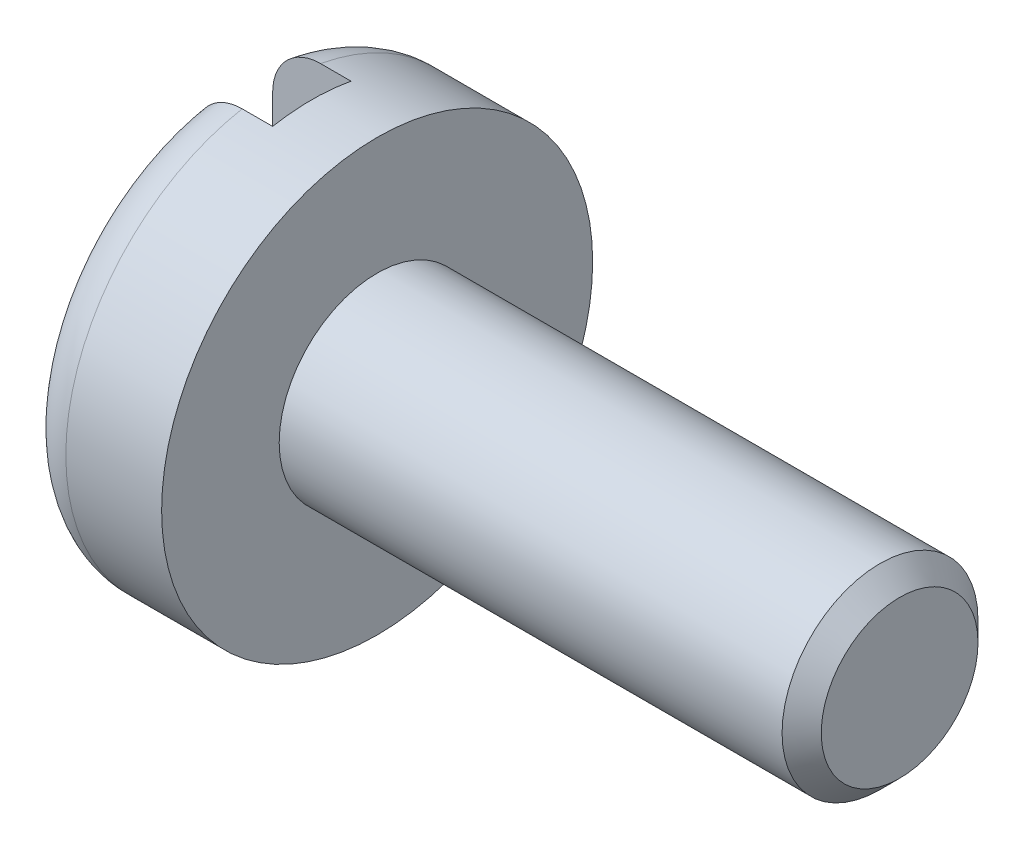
ISO-10303-21;
HEADER;
FILE_DESCRIPTION(('STEP AP214'),'2;1');
FILE_NAME('part.step','',(''),(''),'','','');
FILE_SCHEMA(('AUTOMOTIVE_DESIGN { 1 0 10303 214 1 1 1 1 }'));
ENDSEC;
DATA;
#1=APPLICATION_CONTEXT('core data for automotive mechanical design processes');
#2=APPLICATION_PROTOCOL_DEFINITION('international standard','automotive_design',2000,#1);
#3=PRODUCT_CONTEXT('',#1,'mechanical');
#4=PRODUCT('Part','Part','',(#3));
#5=PRODUCT_RELATED_PRODUCT_CATEGORY('part','',(#4));
#6=PRODUCT_DEFINITION_FORMATION('','',#4);
#7=PRODUCT_DEFINITION_CONTEXT('part definition',#1,'design');
#8=PRODUCT_DEFINITION('design','',#6,#7);
#9=PRODUCT_DEFINITION_SHAPE('','',#8);
#10=(LENGTH_UNIT() NAMED_UNIT(*) SI_UNIT(.MILLI.,.METRE.));
#11=(NAMED_UNIT(*) PLANE_ANGLE_UNIT() SI_UNIT($,.RADIAN.));
#12=(NAMED_UNIT(*) SI_UNIT($,.STERADIAN.) SOLID_ANGLE_UNIT());
#13=UNCERTAINTY_MEASURE_WITH_UNIT(LENGTH_MEASURE(1.E-05),#10,'distance_accuracy_value','');
#14=(GEOMETRIC_REPRESENTATION_CONTEXT(3) GLOBAL_UNCERTAINTY_ASSIGNED_CONTEXT((#13)) GLOBAL_UNIT_ASSIGNED_CONTEXT((#10,
#11,#12)) REPRESENTATION_CONTEXT('',''));
#15=CARTESIAN_POINT('',(0.,0.,0.));
#16=DIRECTION('',(0.,0.,1.));
#17=DIRECTION('',(1.,0.,0.));
#18=AXIS2_PLACEMENT_3D('',#15,#16,#17);
#19=CARTESIAN_POINT('',(-2.19999999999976,0.,-2.56666666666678));
#20=DIRECTION('',(-1.,0.,0.));
#21=DIRECTION('',(0.,0.,1.));
#22=AXIS2_PLACEMENT_3D('',#19,#20,#21);
#23=PLANE('',#22);
#24=DIRECTION('',(0.,1.,0.));
#25=VECTOR('',#24,1.);
#26=CARTESIAN_POINT('',(-2.2000000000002,-3.3,0.599999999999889));
#27=LINE('',#26,#25);
#28=CARTESIAN_POINT('',(-2.2000000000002,-2.49555159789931,0.599999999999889));
#29=VERTEX_POINT('',#28);
#30=CARTESIAN_POINT('',(-2.2000000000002,2.49555159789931,0.599999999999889));
#31=VERTEX_POINT('',#30);
#32=EDGE_CURVE('E514',#29,#31,#27,.T.);
#33=ORIENTED_EDGE('',*,*,#32,.F.);
#34=CARTESIAN_POINT('',(-2.19999999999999,0.,-1.11022302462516E-13));
#35=DIRECTION('',(1.,0.,0.));
#36=DIRECTION('',(0.,0.,-1.));
#37=AXIS2_PLACEMENT_3D('',#34,#35,#36);
#38=CIRCLE('',#37,2.56666666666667);
#39=EDGE_CURVE('E474',#31,#29,#38,.T.);
#40=ORIENTED_EDGE('',*,*,#39,.F.);
#41=EDGE_LOOP('',(#33,#40));
#42=FACE_BOUND('',#41,.T.);
#43=ADVANCED_FACE('F350',(#42),#23,.T.);
#44=CARTESIAN_POINT('',(-1.46666666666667,0.,0.));
#45=DIRECTION('',(1.,0.,0.));
#46=DIRECTION('',(0.,0.,-1.));
#47=AXIS2_PLACEMENT_3D('',#44,#45,#46);
#48=TOROIDAL_SURFACE('',#47,2.56666666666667,0.733333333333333);
#49=ORIENTED_EDGE('',*,*,#39,.T.);
#50=CARTESIAN_POINT('',(-1.85686594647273,-3.1305927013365,0.600000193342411));
#51=CARTESIAN_POINT('',(-1.82259115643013,-3.15252226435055,0.600000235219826));
#52=CARTESIAN_POINT('',(-1.78645539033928,-3.17159394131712,0.600000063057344));
#53=CARTESIAN_POINT('',(-1.71146977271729,-3.20342381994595,0.599999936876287));
#54=CARTESIAN_POINT('',(-1.67261710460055,-3.21617535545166,0.599999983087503));
#55=CARTESIAN_POINT('',(-1.593320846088,-3.23495427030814,0.600000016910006));
#56=CARTESIAN_POINT('',(-1.55287749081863,-3.24098263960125,0.600000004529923));
#57=CARTESIAN_POINT('',(-1.47156303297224,-3.24612916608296,0.599999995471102));
#58=CARTESIAN_POINT('',(-1.4306920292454,-3.24524888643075,0.599999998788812));
#59=CARTESIAN_POINT('',(-1.34985213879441,-3.23662791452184,0.600000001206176));
#60=CARTESIAN_POINT('',(-1.30988021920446,-3.22891562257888,0.600000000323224));
#61=CARTESIAN_POINT('',(-1.23179318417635,-3.20690463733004,0.599999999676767));
#62=CARTESIAN_POINT('',(-1.19367812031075,-3.1926057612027,0.599999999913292));
#63=CARTESIAN_POINT('',(-1.12028004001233,-3.15781176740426,0.600000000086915));
#64=CARTESIAN_POINT('',(-1.08500399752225,-3.13730194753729,0.600000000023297));
#65=CARTESIAN_POINT('',(-1.01834873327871,-3.09071071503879,0.599999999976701));
#66=CARTESIAN_POINT('',(-0.986969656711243,-3.06462909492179,0.599999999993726));
#67=CARTESIAN_POINT('',(-0.928622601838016,-3.00734691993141,0.600000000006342));
#68=CARTESIAN_POINT('',(-0.901706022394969,-2.97609403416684,0.6000000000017));
#69=CARTESIAN_POINT('',(-0.853393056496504,-2.90958117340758,0.599999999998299));
#70=CARTESIAN_POINT('',(-0.831997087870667,-2.87432089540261,0.59999999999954));
#71=CARTESIAN_POINT('',(-0.794911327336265,-2.80012302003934,0.600000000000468));
#72=CARTESIAN_POINT('',(-0.779331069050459,-2.76113069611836,0.600000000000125));
#73=CARTESIAN_POINT('',(-0.754779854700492,-2.68111956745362,0.599999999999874));
#74=CARTESIAN_POINT('',(-0.745809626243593,-2.64010054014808,0.599999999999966));
#75=CARTESIAN_POINT('',(-0.734523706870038,-2.5562302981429,0.600000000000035));
#76=CARTESIAN_POINT('',(-0.732360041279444,-2.51335862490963,0.600000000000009));
#77=CARTESIAN_POINT('',(-0.735108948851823,-2.42784247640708,0.599999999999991));
#78=CARTESIAN_POINT('',(-0.740022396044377,-2.38519802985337,0.599999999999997));
#79=CARTESIAN_POINT('',(-0.756921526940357,-2.30043973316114,0.600000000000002));
#80=CARTESIAN_POINT('',(-0.769047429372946,-2.2583537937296,0.600000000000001));
#81=CARTESIAN_POINT('',(-0.80014124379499,-2.17678558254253,0.599999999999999));
#82=CARTESIAN_POINT('',(-0.819109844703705,-2.13730357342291,0.6));
#83=CARTESIAN_POINT('',(-0.863550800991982,-2.06181705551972,0.6));
#84=CARTESIAN_POINT('',(-0.889066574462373,-2.02583806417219,0.6));
#85=CARTESIAN_POINT('',(-0.945888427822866,-1.95877695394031,0.6));
#86=CARTESIAN_POINT('',(-0.977194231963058,-1.92769460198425,0.6));
#87=CARTESIAN_POINT('',(-1.04409906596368,-1.87204948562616,0.6));
#88=CARTESIAN_POINT('',(-1.07960016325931,-1.84736919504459,0.6));
#89=CARTESIAN_POINT('',(-1.15440279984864,-1.80466130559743,0.6));
#90=CARTESIAN_POINT('',(-1.19370305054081,-1.78663146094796,0.6));
#91=CARTESIAN_POINT('',(-1.27302169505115,-1.75865656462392,0.6));
#92=CARTESIAN_POINT('',(-1.31292067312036,-1.74837302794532,0.6));
#93=CARTESIAN_POINT('',(-1.39390233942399,-1.73498677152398,0.6));
#94=CARTESIAN_POINT('',(-1.43498465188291,-1.7318817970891,0.6));
#95=CARTESIAN_POINT('',(-1.51529396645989,-1.73296378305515,0.6));
#96=CARTESIAN_POINT('',(-1.5545254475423,-1.73684573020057,0.6));
#97=CARTESIAN_POINT('',(-1.63177344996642,-1.75115001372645,0.600000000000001));
#98=CARTESIAN_POINT('',(-1.66978998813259,-1.76157225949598,0.600000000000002));
#99=CARTESIAN_POINT('',(-1.74355654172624,-1.78854205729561,0.599999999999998));
#100=CARTESIAN_POINT('',(-1.7793075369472,-1.80508693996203,0.599999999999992));
#101=CARTESIAN_POINT('',(-1.84767531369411,-1.84371675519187,0.600000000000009));
#102=CARTESIAN_POINT('',(-1.88029155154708,-1.86580264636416,0.600000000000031));
#103=CARTESIAN_POINT('',(-1.94288779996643,-1.91581700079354,0.599999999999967));
#104=CARTESIAN_POINT('',(-1.97270765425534,-1.94394577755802,0.599999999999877));
#105=CARTESIAN_POINT('',(-2.02746613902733,-2.00460841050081,0.600000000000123));
#106=CARTESIAN_POINT('',(-2.05240363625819,-2.03714328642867,0.60000000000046));
#107=CARTESIAN_POINT('',(-2.097891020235,-2.10735324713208,0.59999999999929));
#108=CARTESIAN_POINT('',(-2.11817892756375,-2.14519826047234,0.599999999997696));
#109=CARTESIAN_POINT('',(-2.15229508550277,-2.22369749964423,0.600000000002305));
#110=CARTESIAN_POINT('',(-2.16612233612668,-2.26435215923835,0.600000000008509));
#111=CARTESIAN_POINT('',(-2.18721157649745,-2.34841859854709,0.599999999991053));
#112=CARTESIAN_POINT('',(-2.19430058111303,-2.39187391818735,0.599999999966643));
#113=CARTESIAN_POINT('',(-2.20106750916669,-2.47935880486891,0.600000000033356));
#114=CARTESIAN_POINT('',(-2.20074559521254,-2.52338835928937,0.600000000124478));
#115=CARTESIAN_POINT('',(-2.1926445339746,-2.6106567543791,0.599999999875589));
#116=CARTESIAN_POINT('',(-2.18488269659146,-2.6538971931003,0.59999999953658));
#117=CARTESIAN_POINT('',(-2.16206647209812,-2.73842454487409,0.600000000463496));
#118=CARTESIAN_POINT('',(-2.14701088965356,-2.77971113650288,0.600000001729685));
#119=CARTESIAN_POINT('',(-2.11031567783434,-2.85832675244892,0.599999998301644));
#120=CARTESIAN_POINT('',(-2.08880114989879,-2.89571422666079,0.599999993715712));
#121=CARTESIAN_POINT('',(-2.03967495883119,-2.96619683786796,0.600000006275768));
#122=CARTESIAN_POINT('',(-2.01207160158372,-2.99929772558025,0.600000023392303));
#123=CARTESIAN_POINT('',(-1.96292053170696,-3.04876116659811,0.599999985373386));
#124=CARTESIAN_POINT('',(-1.94297965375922,-3.06674800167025,0.599999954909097));
#125=CARTESIAN_POINT('',(-1.90125077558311,-3.10043483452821,0.600000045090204));
#126=CARTESIAN_POINT('',(-1.87946280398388,-3.1161348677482,0.600000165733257));
#127=CARTESIAN_POINT('',(-1.85686594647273,-3.1305927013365,0.600000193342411));
#128=B_SPLINE_CURVE_WITH_KNOTS('',3,(#50,#51,#52,#53,#54,#55,#56,#57,#58,#59,#60,#61,#62,#63,
#64,#65,#66,#67,#68,#69,#70,#71,#72,#73,#74,#75,#76,#77,#78,#79,#80,#81,#82,#83,#84,#85,#86,#87,
#88,#89,#90,#91,#92,#93,#94,#95,#96,#97,#98,#99,#100,#101,#102,#103,#104,#105,#106,#107,#108,
#109,#110,#111,#112,#113,#114,#115,#116,#117,#118,#119,#120,#121,#122,#123,#124,#125,#126,#127),
.UNSPECIFIED.,.T.,.F.,(4,2,2,2,2,2,2,2,2,2,2,2,2,2,2,2,2,2,2,2,2,2,2,2,2,2,2,2,2,2,2,2,2,2,2,2,
2,2,4),(0.,0.121972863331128,0.244074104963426,0.366157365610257,0.488213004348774,
0.60976363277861,0.73131763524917,0.853161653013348,0.975010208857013,1.09817709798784,
1.22135330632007,1.34674459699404,1.47214968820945,1.60033652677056,1.72853919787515,
1.85931970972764,1.99011339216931,2.12179793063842,2.25347619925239,2.38253169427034,
2.51154356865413,2.63452562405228,2.75746904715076,2.87517487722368,2.99287907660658,
3.11053201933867,3.22820533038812,3.35064196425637,3.47310698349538,3.60134013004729,
3.72959311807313,3.86105616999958,3.99251633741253,4.1236713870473,4.25484793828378,
4.38363183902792,4.51224113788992,4.59265727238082,4.67307216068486),.UNSPECIFIED.);
#129=CARTESIAN_POINT('',(-1.46666666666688,-3.24499614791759,0.6));
#130=VERTEX_POINT('',#129);
#131=EDGE_CURVE('E442',#29,#130,#128,.T.);
#132=ORIENTED_EDGE('',*,*,#131,.T.);
#133=CARTESIAN_POINT('',(-1.46666666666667,0.,0.));
#134=DIRECTION('',(1.,0.,0.));
#135=DIRECTION('',(0.,0.,-1.));
#136=AXIS2_PLACEMENT_3D('',#133,#134,#135);
#137=CIRCLE('',#136,3.3);
#138=CARTESIAN_POINT('',(-1.46666666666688,3.24499614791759,0.6));
#139=VERTEX_POINT('',#138);
#140=EDGE_CURVE('E420',#139,#130,#137,.T.);
#141=ORIENTED_EDGE('',*,*,#140,.F.);
#142=CARTESIAN_POINT('',(-1.70413771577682,1.7741355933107,0.6));
#143=CARTESIAN_POINT('',(-1.66727745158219,1.76081941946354,0.599999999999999));
#144=CARTESIAN_POINT('',(-1.6292910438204,1.75055396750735,0.6));
#145=CARTESIAN_POINT('',(-1.55211105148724,1.73654404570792,0.600000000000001));
#146=CARTESIAN_POINT('',(-1.5129166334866,1.73280418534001,0.6));
#147=CARTESIAN_POINT('',(-1.43445800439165,1.73201000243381,0.6));
#148=CARTESIAN_POINT('',(-1.39519379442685,1.73495557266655,0.600000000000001));
#149=CARTESIAN_POINT('',(-1.31772947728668,1.74740956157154,0.600000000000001));
#150=CARTESIAN_POINT('',(-1.279529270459,1.75691736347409,0.6));
#151=CARTESIAN_POINT('',(-1.20525936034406,1.7821091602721,0.6));
#152=CARTESIAN_POINT('',(-1.16918824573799,1.79778900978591,0.600000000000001));
#153=CARTESIAN_POINT('',(-1.10005212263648,1.83476302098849,0.600000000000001));
#154=CARTESIAN_POINT('',(-1.0669876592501,1.85605819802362,0.6));
#155=CARTESIAN_POINT('',(-1.00342579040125,1.90450266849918,0.6));
#156=CARTESIAN_POINT('',(-0.9730762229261,1.93184577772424,0.600000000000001));
#157=CARTESIAN_POINT('',(-0.917136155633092,1.9910287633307,0.600000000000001));
#158=CARTESIAN_POINT('',(-0.891546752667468,2.02286967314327,0.6));
#159=CARTESIAN_POINT('',(-0.84459503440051,2.09179158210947,0.6));
#160=CARTESIAN_POINT('',(-0.82349341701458,2.1290503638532,0.600000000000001));
#161=CARTESIAN_POINT('',(-0.787651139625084,2.20651275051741,0.600000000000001));
#162=CARTESIAN_POINT('',(-0.77291150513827,2.24671682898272,0.6));
#163=CARTESIAN_POINT('',(-0.749868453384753,2.33010634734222,0.6));
#164=CARTESIAN_POINT('',(-0.741749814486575,2.37334300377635,0.600000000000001));
#165=CARTESIAN_POINT('',(-0.732887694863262,2.46056826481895,0.600000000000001));
#166=CARTESIAN_POINT('',(-0.732144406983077,2.50455688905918,0.6));
#167=CARTESIAN_POINT('',(-0.738115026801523,2.5920059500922,0.6));
#168=CARTESIAN_POINT('',(-0.744824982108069,2.63546665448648,0.600000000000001));
#169=CARTESIAN_POINT('',(-0.765581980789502,2.72060162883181,0.600000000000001));
#170=CARTESIAN_POINT('',(-0.779628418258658,2.76227604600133,0.6));
#171=CARTESIAN_POINT('',(-0.814407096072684,2.8418438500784,0.6));
#172=CARTESIAN_POINT('',(-0.835014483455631,2.87979177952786,0.600000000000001));
#173=CARTESIAN_POINT('',(-0.882449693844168,2.95157921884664,0.600000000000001));
#174=CARTESIAN_POINT('',(-0.909276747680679,2.98541923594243,0.6));
#175=CARTESIAN_POINT('',(-0.967728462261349,3.047209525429,0.6));
#176=CARTESIAN_POINT('',(-0.999229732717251,3.07527653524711,0.600000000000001));
#177=CARTESIAN_POINT('',(-1.06657693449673,3.12559690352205,0.600000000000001));
#178=CARTESIAN_POINT('',(-1.10242237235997,3.1478509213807,0.6));
#179=CARTESIAN_POINT('',(-1.17668606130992,3.18547001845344,0.6));
#180=CARTESIAN_POINT('',(-1.21504080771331,3.20096052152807,0.600000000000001));
#181=CARTESIAN_POINT('',(-1.29382599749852,3.22519218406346,0.600000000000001));
#182=CARTESIAN_POINT('',(-1.33425627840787,3.23393387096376,0.6));
#183=CARTESIAN_POINT('',(-1.41551429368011,3.24433031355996,0.6));
#184=CARTESIAN_POINT('',(-1.45633113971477,3.24607033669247,0.600000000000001));
#185=CARTESIAN_POINT('',(-1.53767316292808,3.24264526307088,0.600000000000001));
#186=CARTESIAN_POINT('',(-1.57819835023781,3.23748040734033,0.6));
#187=CARTESIAN_POINT('',(-1.65765463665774,3.2204362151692,0.6));
#188=CARTESIAN_POINT('',(-1.69659101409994,3.20858145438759,0.600000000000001));
#189=CARTESIAN_POINT('',(-1.77193517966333,3.17853530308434,0.600000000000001));
#190=CARTESIAN_POINT('',(-1.8083429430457,3.16034385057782,0.599999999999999));
#191=CARTESIAN_POINT('',(-1.87780656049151,3.11806046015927,0.6));
#192=CARTESIAN_POINT('',(-1.9108444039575,3.09393895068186,0.600000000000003));
#193=CARTESIAN_POINT('',(-1.97246707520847,3.04055842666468,0.599999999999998));
#194=CARTESIAN_POINT('',(-2.00105168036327,3.01129915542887,0.599999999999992));
#195=CARTESIAN_POINT('',(-2.05337427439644,2.94807119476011,0.600000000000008));
#196=CARTESIAN_POINT('',(-2.07704308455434,2.91404528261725,0.600000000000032));
#197=CARTESIAN_POINT('',(-2.11845961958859,2.8425649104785,0.599999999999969));
#198=CARTESIAN_POINT('',(-2.13620680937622,2.80511014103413,0.599999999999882));
#199=CARTESIAN_POINT('',(-2.16565755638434,2.72705048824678,0.599999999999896));
#200=CARTESIAN_POINT('',(-2.17723501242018,2.68639804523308,0.600000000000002));
#201=CARTESIAN_POINT('',(-2.19356498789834,2.6037458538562,0.599999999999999));
#202=CARTESIAN_POINT('',(-2.1983167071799,2.56174594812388,0.59999999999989));
#203=CARTESIAN_POINT('',(-2.20096414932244,2.47658671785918,0.599999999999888));
#204=CARTESIAN_POINT('',(-2.19870364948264,2.43342252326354,0.6));
#205=CARTESIAN_POINT('',(-2.18709985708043,2.34805717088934,0.600000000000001));
#206=CARTESIAN_POINT('',(-2.17775595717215,2.30585609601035,0.599999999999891));
#207=CARTESIAN_POINT('',(-2.15203833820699,2.22284859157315,0.599999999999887));
#208=CARTESIAN_POINT('',(-2.13554578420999,2.18207892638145,0.599999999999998));
#209=CARTESIAN_POINT('',(-2.09594675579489,2.10386864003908,0.600000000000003));
#210=CARTESIAN_POINT('',(-2.0728381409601,2.06642910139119,0.599999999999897));
#211=CARTESIAN_POINT('',(-2.02059491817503,1.99600282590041,0.59999999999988));
#212=CARTESIAN_POINT('',(-1.99145873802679,1.96301725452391,0.599999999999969));
#213=CARTESIAN_POINT('',(-1.92793336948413,1.90261743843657,0.600000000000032));
#214=CARTESIAN_POINT('',(-1.89355150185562,1.87519555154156,0.600000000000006));
#215=CARTESIAN_POINT('',(-1.83317538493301,1.83528159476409,0.599999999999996));
#216=CARTESIAN_POINT('',(-1.8084046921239,1.82090917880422,0.599999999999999));
#217=CARTESIAN_POINT('',(-1.75733508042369,1.79519495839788,0.600000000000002));
#218=CARTESIAN_POINT('',(-1.73103624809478,1.78385298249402,0.6));
#219=CARTESIAN_POINT('',(-1.70413771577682,1.7741355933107,0.6));
#220=B_SPLINE_CURVE_WITH_KNOTS('',3,(#142,#143,#144,#145,#146,#147,#148,#149,#150,#151,#152,
#153,#154,#155,#156,#157,#158,#159,#160,#161,#162,#163,#164,#165,#166,#167,#168,#169,#170,#171,
#172,#173,#174,#175,#176,#177,#178,#179,#180,#181,#182,#183,#184,#185,#186,#187,#188,#189,#190,
#191,#192,#193,#194,#195,#196,#197,#198,#199,#200,#201,#202,#203,#204,#205,#206,#207,#208,#209,
#210,#211,#212,#213,#214,#215,#216,#217,#218,#219),.UNSPECIFIED.,.T.,.F.,(4,2,2,2,2,2,2,2,2,2,2,
2,2,2,2,2,2,2,2,2,2,2,2,2,2,2,2,2,2,2,2,2,2,2,2,2,2,2,4),(0.,0.117474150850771,
0.235031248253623,0.352586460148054,0.470130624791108,0.587595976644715,0.705082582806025,
0.827092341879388,0.949130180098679,1.07700463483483,1.20489969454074,1.33625243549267,
1.46760861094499,1.59889516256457,1.73017087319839,1.85908439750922,1.98798198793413,
2.11393944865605,2.23988261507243,2.36337926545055,2.48686626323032,2.60884477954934,
2.7308190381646,2.85234810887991,2.97387836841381,3.09602741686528,3.21818256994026,
3.34195502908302,3.46573866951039,3.59196367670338,3.7182034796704,3.84727577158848,
3.9763591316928,4.10767593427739,4.23903526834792,4.37042890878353,4.50164082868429,
4.58737165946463,4.67309763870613),.UNSPECIFIED.);
#221=EDGE_CURVE('E438',#139,#31,#220,.T.);
#222=ORIENTED_EDGE('',*,*,#221,.T.);
#223=EDGE_LOOP('',(#49,#132,#141,#222));
#224=FACE_BOUND('',#223,.T.);
#225=ADVANCED_FACE('F495',(#224),#48,.T.);
#226=CARTESIAN_POINT('',(0.,0.,0.));
#227=DIRECTION('',(-1.,0.,0.));
#228=DIRECTION('',(0.,0.,1.));
#229=AXIS2_PLACEMENT_3D('',#226,#227,#228);
#230=CYLINDRICAL_SURFACE('',#229,1.50000000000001);
#231=CARTESIAN_POINT('',(7.7,0.,-1.07552855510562E-13));
#232=DIRECTION('',(1.,0.,0.));
#233=DIRECTION('',(0.,0.,-1.));
#234=AXIS2_PLACEMENT_3D('',#231,#232,#233);
#235=CIRCLE('',#234,1.50000000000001);
#236=CARTESIAN_POINT('',(7.7,0.,-1.50000000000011));
#237=VERTEX_POINT('',#236);
#238=EDGE_CURVE('E478',#237,#237,#235,.F.);
#239=ORIENTED_EDGE('',*,*,#238,.T.);
#240=EDGE_LOOP('',(#239));
#241=FACE_BOUND('',#240,.T.);
#242=CARTESIAN_POINT('',(0.,0.,0.));
#243=DIRECTION('',(-1.,0.,0.));
#244=DIRECTION('',(0.,0.,1.));
#245=AXIS2_PLACEMENT_3D('',#242,#243,#244);
#246=CIRCLE('',#245,1.50000000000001);
#247=CARTESIAN_POINT('',(0.,0.,1.50000000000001));
#248=VERTEX_POINT('',#247);
#249=EDGE_CURVE('E475',#248,#248,#246,.T.);
#250=ORIENTED_EDGE('',*,*,#249,.F.);
#251=EDGE_LOOP('',(#250));
#252=FACE_BOUND('',#251,.T.);
#253=ADVANCED_FACE('F352',(#241,#252),#230,.T.);
#254=CARTESIAN_POINT('',(8.00000000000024,0.,-1.5));
#255=DIRECTION('',(1.,0.,0.));
#256=DIRECTION('',(0.,0.,-1.));
#257=AXIS2_PLACEMENT_3D('',#254,#255,#256);
#258=PLANE('',#257);
#259=CARTESIAN_POINT('',(8.00000000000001,0.,0.));
#260=DIRECTION('',(1.,0.,0.));
#261=DIRECTION('',(0.,0.,-1.));
#262=AXIS2_PLACEMENT_3D('',#259,#260,#261);
#263=CIRCLE('',#262,1.2);
#264=CARTESIAN_POINT('',(8.00000000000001,0.,-1.2));
#265=VERTEX_POINT('',#264);
#266=EDGE_CURVE('E410',#265,#265,#263,.T.);
#267=ORIENTED_EDGE('',*,*,#266,.T.);
#268=EDGE_LOOP('',(#267));
#269=FACE_BOUND('',#268,.T.);
#270=ADVANCED_FACE('F484',(#269),#258,.T.);
#271=CARTESIAN_POINT('',(7.7,0.,-1.07552855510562E-13));
#272=DIRECTION('',(-1.,0.,0.));
#273=DIRECTION('',(0.,0.,1.));
#274=AXIS2_PLACEMENT_3D('',#271,#272,#273);
#275=CONICAL_SURFACE('',#274,1.50000000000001,0.785398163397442);
#276=ORIENTED_EDGE('',*,*,#266,.F.);
#277=EDGE_LOOP('',(#276));
#278=FACE_BOUND('',#277,.T.);
#279=ORIENTED_EDGE('',*,*,#238,.F.);
#280=EDGE_LOOP('',(#279));
#281=FACE_BOUND('',#280,.T.);
#282=ADVANCED_FACE('F486',(#278,#281),#275,.T.);
#283=CARTESIAN_POINT('',(0.,0.,0.));
#284=DIRECTION('',(1.,0.,0.));
#285=DIRECTION('',(0.,0.,-1.));
#286=AXIS2_PLACEMENT_3D('',#283,#284,#285);
#287=PLANE('',#286);
#288=CARTESIAN_POINT('',(0.,0.,0.));
#289=DIRECTION('',(1.,0.,0.));
#290=DIRECTION('',(0.,0.,-1.));
#291=AXIS2_PLACEMENT_3D('',#288,#289,#290);
#292=CIRCLE('',#291,3.3);
#293=CARTESIAN_POINT('',(0.,0.,-3.3));
#294=VERTEX_POINT('',#293);
#295=EDGE_CURVE('E469',#294,#294,#292,.T.);
#296=ORIENTED_EDGE('',*,*,#295,.T.);
#297=EDGE_LOOP('',(#296));
#298=FACE_BOUND('',#297,.T.);
#299=ORIENTED_EDGE('',*,*,#249,.T.);
#300=EDGE_LOOP('',(#299));
#301=FACE_BOUND('',#300,.T.);
#302=ADVANCED_FACE('F489',(#298,#301),#287,.T.);
#303=DIRECTION('',(0.,-1.,0.));
#304=VECTOR('',#303,1.);
#305=CARTESIAN_POINT('',(-2.19999999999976,3.3,-0.600000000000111));
#306=LINE('',#305,#304);
#307=CARTESIAN_POINT('',(-2.19999999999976,2.49555159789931,-0.600000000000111));
#308=VERTEX_POINT('',#307);
#309=CARTESIAN_POINT('',(-2.19999999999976,-2.49555159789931,-0.600000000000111));
#310=VERTEX_POINT('',#309);
#311=EDGE_CURVE('E414',#308,#310,#306,.T.);
#312=ORIENTED_EDGE('',*,*,#311,.F.);
#313=EDGE_CURVE('E437',#310,#308,#38,.T.);
#314=ORIENTED_EDGE('',*,*,#313,.F.);
#315=EDGE_LOOP('',(#312,#314));
#316=FACE_BOUND('',#315,.T.);
#317=ADVANCED_FACE('F499',(#316),#23,.T.);
#318=CARTESIAN_POINT('',(-1.46666666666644,-3.24499614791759,-0.6));
#319=VERTEX_POINT('',#318);
#320=CARTESIAN_POINT('',(-1.46666666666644,3.24499614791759,-0.6));
#321=VERTEX_POINT('',#320);
#322=EDGE_CURVE('E426',#319,#321,#137,.T.);
#323=ORIENTED_EDGE('',*,*,#322,.F.);
#324=CARTESIAN_POINT('',(-1.85686585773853,-3.13059256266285,-0.6));
#325=CARTESIAN_POINT('',(-1.8918724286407,-3.10819029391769,-0.6));
#326=CARTESIAN_POINT('',(-1.92498961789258,-3.0827726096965,-0.599999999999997));
#327=CARTESIAN_POINT('',(-1.98648626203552,-3.0266883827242,-0.600000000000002));
#328=CARTESIAN_POINT('',(-2.01485901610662,-2.99601453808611,-0.600000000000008));
#329=CARTESIAN_POINT('',(-2.06604083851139,-2.93039579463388,-0.599999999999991));
#330=CARTESIAN_POINT('',(-2.08885714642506,-2.89545654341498,-0.599999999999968));
#331=CARTESIAN_POINT('',(-2.1283929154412,-2.82230170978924,-0.600000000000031));
#332=CARTESIAN_POINT('',(-2.14511387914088,-2.78408693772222,-0.600000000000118));
#333=CARTESIAN_POINT('',(-2.17229187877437,-2.70484131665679,-0.600000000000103));
#334=CARTESIAN_POINT('',(-2.18264964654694,-2.66377644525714,-0.599999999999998));
#335=CARTESIAN_POINT('',(-2.19648977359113,-2.58050305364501,-0.600000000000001));
#336=CARTESIAN_POINT('',(-2.19997103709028,-2.53829435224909,-0.600000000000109));
#337=CARTESIAN_POINT('',(-2.20002924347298,-2.45292624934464,-0.600000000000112));
#338=CARTESIAN_POINT('',(-2.19644982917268,-2.40976672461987,-0.600000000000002));
#339=CARTESIAN_POINT('',(-2.1822197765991,-2.32462798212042,-0.599999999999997));
#340=CARTESIAN_POINT('',(-2.1715682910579,-2.28264890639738,-0.600000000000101));
#341=CARTESIAN_POINT('',(-2.14326637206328,-2.20034623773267,-0.600000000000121));
#342=CARTESIAN_POINT('',(-2.12550415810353,-2.16006102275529,-0.600000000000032));
#343=CARTESIAN_POINT('',(-2.08345482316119,-2.08304639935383,-0.599999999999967));
#344=CARTESIAN_POINT('',(-2.05916729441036,-2.0463172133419,-0.599999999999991));
#345=CARTESIAN_POINT('',(-2.00475544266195,-1.97761751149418,-0.600000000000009));
#346=CARTESIAN_POINT('',(-1.97464634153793,-1.94563496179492,-0.600000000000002));
#347=CARTESIAN_POINT('',(-1.90932799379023,-1.88737933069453,-0.599999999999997));
#348=CARTESIAN_POINT('',(-1.87411958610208,-1.86110531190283,-0.599999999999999));
#349=CARTESIAN_POINT('',(-1.80078202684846,-1.81599325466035,-0.6));
#350=CARTESIAN_POINT('',(-1.76278403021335,-1.79694235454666,-0.6));
#351=CARTESIAN_POINT('',(-1.68401293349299,-1.76588073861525,-0.599999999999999));
#352=CARTESIAN_POINT('',(-1.64324091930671,-1.75386728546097,-0.6));
#353=CARTESIAN_POINT('',(-1.56229128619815,-1.7378279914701,-0.6));
#354=CARTESIAN_POINT('',(-1.52218714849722,-1.73343033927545,-0.6));
#355=CARTESIAN_POINT('',(-1.44182725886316,-1.73165236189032,-0.6));
#356=CARTESIAN_POINT('',(-1.40157153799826,-1.73427066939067,-0.6));
#357=CARTESIAN_POINT('',(-1.32326208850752,-1.74623189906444,-0.6));
#358=CARTESIAN_POINT('',(-1.28517831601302,-1.75537998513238,-0.6));
#359=CARTESIAN_POINT('',(-1.21104161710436,-1.7798234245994,-0.6));
#360=CARTESIAN_POINT('',(-1.17498885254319,-1.7951192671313,-0.6));
#361=CARTESIAN_POINT('',(-1.10516665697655,-1.83165451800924,-0.6));
#362=CARTESIAN_POINT('',(-1.07145332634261,-1.85300089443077,-0.6));
#363=CARTESIAN_POINT('',(-1.00787374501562,-1.90080593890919,-0.6));
#364=CARTESIAN_POINT('',(-0.978008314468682,-1.92726569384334,-0.6));
#365=CARTESIAN_POINT('',(-0.921463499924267,-1.98589673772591,-0.6));
#366=CARTESIAN_POINT('',(-0.895004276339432,-2.01828038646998,-0.6));
#367=CARTESIAN_POINT('',(-0.847642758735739,-2.08688429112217,-0.6));
#368=CARTESIAN_POINT('',(-0.826741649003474,-2.12310536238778,-0.6));
#369=CARTESIAN_POINT('',(-0.7902600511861,-2.1999424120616,-0.6));
#370=CARTESIAN_POINT('',(-0.774928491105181,-2.24067679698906,-0.6));
#371=CARTESIAN_POINT('',(-0.751216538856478,-2.32412310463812,-0.6));
#372=CARTESIAN_POINT('',(-0.742836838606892,-2.3668352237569,-0.6));
#373=CARTESIAN_POINT('',(-0.733224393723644,-2.45364117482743,-0.6));
#374=CARTESIAN_POINT('',(-0.732088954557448,-2.49774585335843,-0.6));
#375=CARTESIAN_POINT('',(-0.737319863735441,-2.58551066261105,-0.6));
#376=CARTESIAN_POINT('',(-0.743685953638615,-2.62917080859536,-0.6));
#377=CARTESIAN_POINT('',(-0.763707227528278,-2.7143048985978,-0.6));
#378=CARTESIAN_POINT('',(-0.777285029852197,-2.75579700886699,-0.6));
#379=CARTESIAN_POINT('',(-0.811366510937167,-2.83583435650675,-0.6));
#380=CARTESIAN_POINT('',(-0.83186944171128,-2.87437991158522,-0.6));
#381=CARTESIAN_POINT('',(-0.878747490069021,-2.94653403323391,-0.6));
#382=CARTESIAN_POINT('',(-0.904985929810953,-2.98023138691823,-0.6));
#383=CARTESIAN_POINT('',(-0.962863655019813,-3.04261716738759,-0.6));
#384=CARTESIAN_POINT('',(-0.994502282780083,-3.07130620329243,-0.6));
#385=CARTESIAN_POINT('',(-1.06153116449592,-3.12220128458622,-0.6));
#386=CARTESIAN_POINT('',(-1.09682411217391,-3.14453551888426,-0.6));
#387=CARTESIAN_POINT('',(-1.17070519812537,-3.1828462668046,-0.6));
#388=CARTESIAN_POINT('',(-1.20929287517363,-3.19882366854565,-0.6));
#389=CARTESIAN_POINT('',(-1.28798576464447,-3.22371171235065,-0.6));
#390=CARTESIAN_POINT('',(-1.32805572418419,-3.23273392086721,-0.6));
#391=CARTESIAN_POINT('',(-1.40915597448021,-3.2438628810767,-0.6));
#392=CARTESIAN_POINT('',(-1.45018645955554,-3.24596822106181,-0.6));
#393=CARTESIAN_POINT('',(-1.53168875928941,-3.24320697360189,-0.6));
#394=CARTESIAN_POINT('',(-1.57216244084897,-3.2383941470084,-0.6));
#395=CARTESIAN_POINT('',(-1.65168983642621,-3.22204225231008,-0.6));
#396=CARTESIAN_POINT('',(-1.69074529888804,-3.21051178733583,-0.6));
#397=CARTESIAN_POINT('',(-1.75093890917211,-3.18710114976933,-0.6));
#398=CARTESIAN_POINT('',(-1.7728983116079,-3.17727443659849,-0.6));
#399=CARTESIAN_POINT('',(-1.81573778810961,-3.15549892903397,-0.6));
#400=CARTESIAN_POINT('',(-1.83661787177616,-3.14355015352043,-0.6));
#401=CARTESIAN_POINT('',(-1.85686585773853,-3.13059256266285,-0.6));
#402=B_SPLINE_CURVE_WITH_KNOTS('',3,(#324,#325,#326,#327,#328,#329,#330,#331,#332,#333,#334,
#335,#336,#337,#338,#339,#340,#341,#342,#343,#344,#345,#346,#347,#348,#349,#350,#351,#352,#353,
#354,#355,#356,#357,#358,#359,#360,#361,#362,#363,#364,#365,#366,#367,#368,#369,#370,#371,#372,
#373,#374,#375,#376,#377,#378,#379,#380,#381,#382,#383,#384,#385,#386,#387,#388,#389,#390,#391,
#392,#393,#394,#395,#396,#397,#398,#399,#400,#401),.UNSPECIFIED.,.T.,.F.,(4,2,2,2,2,2,2,2,2,2,2,
2,2,2,2,2,2,2,2,2,2,2,2,2,2,2,2,2,2,2,2,2,2,2,2,2,2,2,4),(0.,0.124593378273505,
0.249361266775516,0.373965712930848,0.498539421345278,0.625010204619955,0.751501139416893,
0.880824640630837,1.0101636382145,1.14162112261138,1.27308682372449,1.40421331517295,
1.53531825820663,1.66218643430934,1.78900523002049,1.90943700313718,2.02984530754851,
2.14680344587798,2.26377089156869,2.3829511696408,2.50215680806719,2.62705316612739,
2.75197611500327,2.88194347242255,3.01192376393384,3.14364634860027,3.27536439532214,
3.40569684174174,3.5360152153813,3.66351345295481,3.79099617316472,3.91568772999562,
4.04036185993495,4.16299192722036,4.28564702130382,4.40735410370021,4.52890566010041,
4.60097177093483,4.67303724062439),.UNSPECIFIED.);
#403=EDGE_CURVE('E439',#319,#310,#402,.T.);
#404=ORIENTED_EDGE('',*,*,#403,.T.);
#405=ORIENTED_EDGE('',*,*,#313,.T.);
#406=CARTESIAN_POINT('',(-1.70413789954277,1.77413508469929,-0.599999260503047));
#407=CARTESIAN_POINT('',(-1.74312160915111,1.78822245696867,-0.59999897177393));
#408=CARTESIAN_POINT('',(-1.78090427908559,1.80574591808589,-0.599999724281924));
#409=CARTESIAN_POINT('',(-1.85297636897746,1.84698020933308,-0.60000027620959));
#410=CARTESIAN_POINT('',(-1.88725944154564,1.87070201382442,-0.600000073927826));
#411=CARTESIAN_POINT('',(-1.9513341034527,1.92343053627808,-0.599999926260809));
#412=CARTESIAN_POINT('',(-1.98113693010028,1.95242361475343,-0.599999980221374));
#413=CARTESIAN_POINT('',(-2.0356442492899,2.01483510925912,-0.600000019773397));
#414=CARTESIAN_POINT('',(-2.06035008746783,2.0482523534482,-0.600000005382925));
#415=CARTESIAN_POINT('',(-2.10488235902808,2.11982725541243,-0.599999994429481));
#416=CARTESIAN_POINT('',(-2.12450846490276,2.15810963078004,-0.599999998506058));
#417=CARTESIAN_POINT('',(-2.15722997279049,2.23737506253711,-0.600000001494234));
#418=CARTESIAN_POINT('',(-2.17032409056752,2.27835864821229,-0.600000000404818));
#419=CARTESIAN_POINT('',(-2.18985501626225,2.36290857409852,-0.599999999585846));
#420=CARTESIAN_POINT('',(-2.19612730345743,2.40651305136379,-0.599999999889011));
#421=CARTESIAN_POINT('',(-2.20123739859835,2.49415814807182,-0.60000000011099));
#422=CARTESIAN_POINT('',(-2.20007513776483,2.53819877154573,-0.6000000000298));
#423=CARTESIAN_POINT('',(-2.19029832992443,2.62529290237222,-0.599999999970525));
#424=CARTESIAN_POINT('',(-2.18170985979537,2.66834932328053,-0.59999999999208));
#425=CARTESIAN_POINT('',(-2.15728299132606,2.75235631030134,-0.600000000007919));
#426=CARTESIAN_POINT('',(-2.14144528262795,2.79330707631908,-0.600000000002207));
#427=CARTESIAN_POINT('',(-2.10328230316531,2.87108922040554,-0.599999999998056));
#428=CARTESIAN_POINT('',(-2.08108775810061,2.90798471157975,-0.599999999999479));
#429=CARTESIAN_POINT('',(-2.03068330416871,2.97741029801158,-0.60000000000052));
#430=CARTESIAN_POINT('',(-2.00247413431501,3.00994092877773,-0.600000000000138));
#431=CARTESIAN_POINT('',(-1.9415350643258,3.0689295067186,-0.599999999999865));
#432=CARTESIAN_POINT('',(-1.90892247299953,3.09550866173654,-0.599999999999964));
#433=CARTESIAN_POINT('',(-1.83962709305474,3.14268999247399,-0.600000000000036));
#434=CARTESIAN_POINT('',(-1.80294475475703,3.16329282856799,-0.600000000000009));
#435=CARTESIAN_POINT('',(-1.72729178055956,3.19754577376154,-0.59999999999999));
#436=CARTESIAN_POINT('',(-1.68837657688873,3.21131837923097,-0.599999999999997));
#437=CARTESIAN_POINT('',(-1.60877224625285,3.23205168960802,-0.600000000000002));
#438=CARTESIAN_POINT('',(-1.5680832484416,3.23901288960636,-0.600000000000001));
#439=CARTESIAN_POINT('',(-1.486573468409,3.24586763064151,-0.599999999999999));
#440=CARTESIAN_POINT('',(-1.44575923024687,3.24583921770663,-0.6));
#441=CARTESIAN_POINT('',(-1.36471917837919,3.23891112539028,-0.6));
#442=CARTESIAN_POINT('',(-1.32449334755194,3.23201164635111,-0.6));
#443=CARTESIAN_POINT('',(-1.2458736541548,3.21157932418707,-0.6));
#444=CARTESIAN_POINT('',(-1.20747541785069,3.19806329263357,-0.6));
#445=CARTESIAN_POINT('',(-1.1334737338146,3.16481474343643,-0.6));
#446=CARTESIAN_POINT('',(-1.09787032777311,3.14508213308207,-0.6));
#447=CARTESIAN_POINT('',(-1.03022126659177,3.09984813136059,-0.6));
#448=CARTESIAN_POINT('',(-0.99819895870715,3.07431184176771,-0.6));
#449=CARTESIAN_POINT('',(-0.938822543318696,3.01829409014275,-0.6));
#450=CARTESIAN_POINT('',(-0.911468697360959,2.98781235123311,-0.599999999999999));
#451=CARTESIAN_POINT('',(-0.861777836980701,2.92231728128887,-0.600000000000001));
#452=CARTESIAN_POINT('',(-0.839517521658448,2.88724578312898,-0.600000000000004));
#453=CARTESIAN_POINT('',(-0.801066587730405,2.8139220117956,-0.599999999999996));
#454=CARTESIAN_POINT('',(-0.784876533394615,2.77566944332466,-0.599999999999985));
#455=CARTESIAN_POINT('',(-0.758668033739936,2.69624179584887,-0.600000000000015));
#456=CARTESIAN_POINT('',(-0.748781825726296,2.65502309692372,-0.600000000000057));
#457=CARTESIAN_POINT('',(-0.735904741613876,2.57152333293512,-0.599999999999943));
#458=CARTESIAN_POINT('',(-0.732914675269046,2.52924214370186,-0.599999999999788));
#459=CARTESIAN_POINT('',(-0.733856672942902,2.44381257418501,-0.600000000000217));
#460=CARTESIAN_POINT('',(-0.737944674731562,2.40066589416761,-0.600000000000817));
#461=CARTESIAN_POINT('',(-0.753185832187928,2.31563707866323,-0.599999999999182));
#462=CARTESIAN_POINT('',(-0.76433985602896,2.27375509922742,-0.599999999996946));
#463=CARTESIAN_POINT('',(-0.793631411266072,2.19175023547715,-0.600000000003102));
#464=CARTESIAN_POINT('',(-0.811877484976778,2.15166606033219,-0.600000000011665));
#465=CARTESIAN_POINT('',(-0.854860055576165,2.0751358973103,-0.599999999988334));
#466=CARTESIAN_POINT('',(-0.879596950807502,2.03869013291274,-0.599999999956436));
#467=CARTESIAN_POINT('',(-0.93483503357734,1.97066818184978,-0.600000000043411));
#468=CARTESIAN_POINT('',(-0.965315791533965,1.93907543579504,-0.600000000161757));
#469=CARTESIAN_POINT('',(-1.03130810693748,1.88166683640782,-0.599999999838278));
#470=CARTESIAN_POINT('',(-1.06681856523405,1.8558497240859,-0.599999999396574));
#471=CARTESIAN_POINT('',(-1.14062627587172,1.81171792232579,-0.600000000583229));
#472=CARTESIAN_POINT('',(-1.17879047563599,1.7931810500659,-0.600000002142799));
#473=CARTESIAN_POINT('',(-1.25781213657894,1.76316447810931,-0.599999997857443));
#474=CARTESIAN_POINT('',(-1.29866929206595,1.75168397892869,-0.599999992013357));
#475=CARTESIAN_POINT('',(-1.37970494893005,1.73668085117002,-0.600000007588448));
#476=CARTESIAN_POINT('',(-1.41981572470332,1.7327900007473,-0.600000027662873));
#477=CARTESIAN_POINT('',(-1.5000655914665,1.73201833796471,-0.599999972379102));
#478=CARTESIAN_POINT('',(-1.5402045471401,1.73512689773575,-0.599999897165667));
#479=CARTESIAN_POINT('',(-1.60091978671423,1.74514432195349,-0.600000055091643));
#480=CARTESIAN_POINT('',(-1.6219266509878,1.74961879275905,-0.600000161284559));
#481=CARTESIAN_POINT('',(-1.66344230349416,1.76046683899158,-0.599999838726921));
#482=CARTESIAN_POINT('',(-1.68395112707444,1.76684027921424,-0.599999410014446));
#483=CARTESIAN_POINT('',(-1.70413789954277,1.77413508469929,-0.599999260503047));
#484=B_SPLINE_CURVE_WITH_KNOTS('',3,(#406,#407,#408,#409,#410,#411,#412,#413,#414,#415,#416,
#417,#418,#419,#420,#421,#422,#423,#424,#425,#426,#427,#428,#429,#430,#431,#432,#433,#434,#435,
#436,#437,#438,#439,#440,#441,#442,#443,#444,#445,#446,#447,#448,#449,#450,#451,#452,#453,#454,
#455,#456,#457,#458,#459,#460,#461,#462,#463,#464,#465,#466,#467,#468,#469,#470,#471,#472,#473,
#474,#475,#476,#477,#478,#479,#480,#481,#482,#483),.UNSPECIFIED.,.T.,.F.,(4,2,2,2,2,2,2,2,2,2,2,
2,2,2,2,2,2,2,2,2,2,2,2,2,2,2,2,2,2,2,2,2,2,2,2,2,2,2,4),(0.,0.12426983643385,0.248761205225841,
0.372934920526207,0.497075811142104,0.625548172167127,0.754045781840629,0.885577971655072,
1.01711137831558,1.14818477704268,1.27924570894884,1.4077842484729,1.53630700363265,
1.66190891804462,1.78749694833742,1.91074288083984,2.03397985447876,2.15584082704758,
2.27769824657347,2.39924764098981,2.52079884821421,2.64310125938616,2.76541052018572,
2.88945540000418,3.01351180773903,3.14009168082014,3.26668641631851,3.39610578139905,
3.52554105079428,3.65704067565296,3.78854837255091,3.91959686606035,4.0506167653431,
4.17725147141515,4.30387182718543,4.42417920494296,4.54430403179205,4.60865874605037,
4.67300887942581),.UNSPECIFIED.);
#485=EDGE_CURVE('E430',#308,#321,#484,.T.);
#486=ORIENTED_EDGE('',*,*,#485,.T.);
#487=EDGE_LOOP('',(#323,#404,#405,#486));
#488=FACE_BOUND('',#487,.T.);
#489=ADVANCED_FACE('F434',(#488),#48,.T.);
#490=CARTESIAN_POINT('',(0.,0.,0.));
#491=DIRECTION('',(1.,0.,0.));
#492=DIRECTION('',(0.,0.,-1.));
#493=AXIS2_PLACEMENT_3D('',#490,#491,#492);
#494=CYLINDRICAL_SURFACE('',#493,3.3);
#495=CARTESIAN_POINT('',(-1.,0.,0.));
#496=DIRECTION('',(1.,0.,0.));
#497=DIRECTION('',(0.,0.,-1.));
#498=AXIS2_PLACEMENT_3D('',#495,#496,#497);
#499=CIRCLE('',#498,3.3);
#500=CARTESIAN_POINT('',(-0.999999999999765,3.24499614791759,-0.6));
#501=VERTEX_POINT('',#500);
#502=CARTESIAN_POINT('',(-1.00000000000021,3.24499614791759,0.6));
#503=VERTEX_POINT('',#502);
#504=EDGE_CURVE('E412',#501,#503,#499,.T.);
#505=ORIENTED_EDGE('',*,*,#504,.T.);
#506=DIRECTION('',(1.,0.,0.));
#507=VECTOR('',#506,1.);
#508=CARTESIAN_POINT('',(-2.08166817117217E-13,3.24499614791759,0.6));
#509=LINE('',#508,#507);
#510=EDGE_CURVE('E11',#503,#139,#509,.F.);
#511=ORIENTED_EDGE('',*,*,#510,.T.);
#512=ORIENTED_EDGE('',*,*,#140,.T.);
#513=DIRECTION('',(1.,0.,0.));
#514=VECTOR('',#513,1.);
#515=CARTESIAN_POINT('',(-2.08166817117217E-13,-3.24499614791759,0.6));
#516=LINE('',#515,#514);
#517=CARTESIAN_POINT('',(-1.00000000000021,-3.24499614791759,0.6));
#518=VERTEX_POINT('',#517);
#519=EDGE_CURVE('E373',#130,#518,#516,.T.);
#520=ORIENTED_EDGE('',*,*,#519,.T.);
#521=CARTESIAN_POINT('',(-0.999999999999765,-3.24499614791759,-0.6));
#522=VERTEX_POINT('',#521);
#523=EDGE_CURVE('E403',#518,#522,#499,.T.);
#524=ORIENTED_EDGE('',*,*,#523,.T.);
#525=DIRECTION('',(1.,0.,0.));
#526=VECTOR('',#525,1.);
#527=CARTESIAN_POINT('',(2.35922392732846E-13,-3.24499614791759,-0.6));
#528=LINE('',#527,#526);
#529=EDGE_CURVE('E409',#522,#319,#528,.F.);
#530=ORIENTED_EDGE('',*,*,#529,.T.);
#531=ORIENTED_EDGE('',*,*,#322,.T.);
#532=DIRECTION('',(1.,0.,0.));
#533=VECTOR('',#532,1.);
#534=CARTESIAN_POINT('',(2.35922392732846E-13,3.24499614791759,-0.6));
#535=LINE('',#534,#533);
#536=EDGE_CURVE('E358',#321,#501,#535,.T.);
#537=ORIENTED_EDGE('',*,*,#536,.T.);
#538=EDGE_LOOP('',(#505,#511,#512,#520,#524,#530,#531,#537));
#539=FACE_BOUND('',#538,.T.);
#540=ORIENTED_EDGE('',*,*,#295,.F.);
#541=EDGE_LOOP('',(#540));
#542=FACE_BOUND('',#541,.T.);
#543=ADVANCED_FACE('F417',(#539,#542),#494,.T.);
#544=CARTESIAN_POINT('',(-1.00000000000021,-3.3,0.6));
#545=DIRECTION('',(0.,0.,1.));
#546=DIRECTION('',(1.,0.,0.));
#547=AXIS2_PLACEMENT_3D('',#544,#545,#546);
#548=PLANE('',#547);
#549=ORIENTED_EDGE('',*,*,#32,.T.);
#550=ORIENTED_EDGE('',*,*,#221,.F.);
#551=ORIENTED_EDGE('',*,*,#510,.F.);
#552=DIRECTION('',(0.,1.,0.));
#553=VECTOR('',#552,1.);
#554=CARTESIAN_POINT('',(-1.00000000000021,-3.3,0.6));
#555=LINE('',#554,#553);
#556=EDGE_CURVE('E405',#518,#503,#555,.T.);
#557=ORIENTED_EDGE('',*,*,#556,.F.);
#558=ORIENTED_EDGE('',*,*,#519,.F.);
#559=ORIENTED_EDGE('',*,*,#131,.F.);
#560=EDGE_LOOP('',(#549,#550,#551,#557,#558,#559));
#561=FACE_BOUND('',#560,.T.);
#562=ADVANCED_FACE('F413',(#561),#548,.F.);
#563=CARTESIAN_POINT('',(-0.999999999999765,3.3,-0.6));
#564=DIRECTION('',(0.,0.,-1.));
#565=DIRECTION('',(-1.,0.,0.));
#566=AXIS2_PLACEMENT_3D('',#563,#564,#565);
#567=PLANE('',#566);
#568=ORIENTED_EDGE('',*,*,#311,.T.);
#569=ORIENTED_EDGE('',*,*,#403,.F.);
#570=ORIENTED_EDGE('',*,*,#529,.F.);
#571=DIRECTION('',(0.,-1.,0.));
#572=VECTOR('',#571,1.);
#573=CARTESIAN_POINT('',(-0.999999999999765,3.3,-0.6));
#574=LINE('',#573,#572);
#575=EDGE_CURVE('E365',#501,#522,#574,.T.);
#576=ORIENTED_EDGE('',*,*,#575,.F.);
#577=ORIENTED_EDGE('',*,*,#536,.F.);
#578=ORIENTED_EDGE('',*,*,#485,.F.);
#579=EDGE_LOOP('',(#568,#569,#570,#576,#577,#578));
#580=FACE_BOUND('',#579,.T.);
#581=ADVANCED_FACE('F429',(#580),#567,.F.);
#582=CARTESIAN_POINT('',(-0.999999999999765,3.3,-0.6));
#583=DIRECTION('',(1.,0.,0.));
#584=DIRECTION('',(0.,0.,-1.));
#585=AXIS2_PLACEMENT_3D('',#582,#583,#584);
#586=PLANE('',#585);
#587=ORIENTED_EDGE('',*,*,#575,.T.);
#588=ORIENTED_EDGE('',*,*,#523,.F.);
#589=ORIENTED_EDGE('',*,*,#556,.T.);
#590=ORIENTED_EDGE('',*,*,#504,.F.);
#591=EDGE_LOOP('',(#587,#588,#589,#590));
#592=FACE_BOUND('',#591,.T.);
#593=ADVANCED_FACE('F404',(#592),#586,.F.);
#594=CLOSED_SHELL('',(#43,#225,#253,#270,#282,#302,#317,#489,#543,#562,#581,#593));
#595=MANIFOLD_SOLID_BREP('B2',#594);
#596=ADVANCED_BREP_SHAPE_REPRESENTATION('',(#18,#595),#14);
#597=SHAPE_DEFINITION_REPRESENTATION(#9,#596);
ENDSEC;
END-ISO-10303-21;
